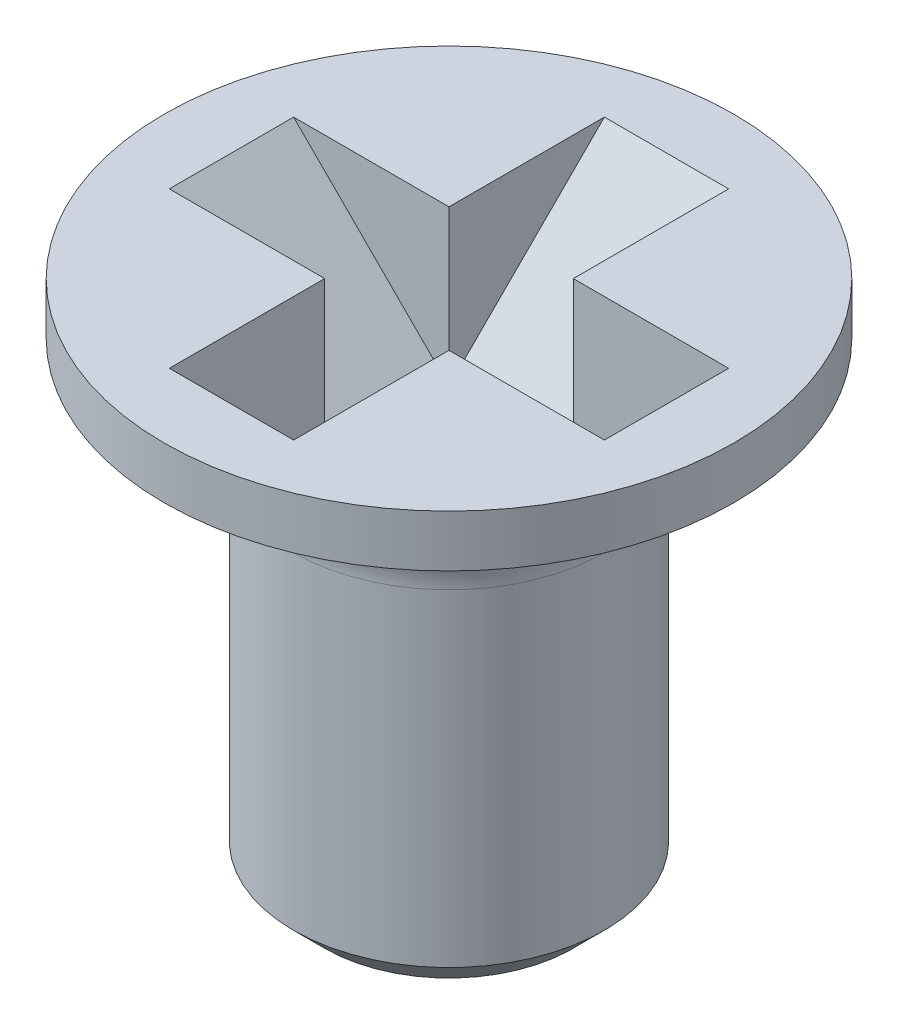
ISO-10303-21;
HEADER;
FILE_DESCRIPTION(('STEP AP214'),'2;1');
FILE_NAME('part.step','',(''),(''),'','','');
FILE_SCHEMA(('AUTOMOTIVE_DESIGN { 1 0 10303 214 1 1 1 1 }'));
ENDSEC;
DATA;
#1=APPLICATION_CONTEXT('core data for automotive mechanical design processes');
#2=APPLICATION_PROTOCOL_DEFINITION('international standard','automotive_design',2000,#1);
#3=PRODUCT_CONTEXT('',#1,'mechanical');
#4=PRODUCT('Part','Part','',(#3));
#5=PRODUCT_RELATED_PRODUCT_CATEGORY('part','',(#4));
#6=PRODUCT_DEFINITION_FORMATION('','',#4);
#7=PRODUCT_DEFINITION_CONTEXT('part definition',#1,'design');
#8=PRODUCT_DEFINITION('design','',#6,#7);
#9=PRODUCT_DEFINITION_SHAPE('','',#8);
#10=(LENGTH_UNIT() NAMED_UNIT(*) SI_UNIT(.MILLI.,.METRE.));
#11=(NAMED_UNIT(*) PLANE_ANGLE_UNIT() SI_UNIT($,.RADIAN.));
#12=(NAMED_UNIT(*) SI_UNIT($,.STERADIAN.) SOLID_ANGLE_UNIT());
#13=UNCERTAINTY_MEASURE_WITH_UNIT(LENGTH_MEASURE(1.E-05),#10,'distance_accuracy_value','');
#14=(GEOMETRIC_REPRESENTATION_CONTEXT(3) GLOBAL_UNCERTAINTY_ASSIGNED_CONTEXT((#13)) GLOBAL_UNIT_ASSIGNED_CONTEXT((#10,
#11,#12)) REPRESENTATION_CONTEXT('',''));
#15=CARTESIAN_POINT('',(0.,0.,0.));
#16=DIRECTION('',(0.,0.,1.));
#17=DIRECTION('',(1.,0.,0.));
#18=AXIS2_PLACEMENT_3D('',#15,#16,#17);
#19=CARTESIAN_POINT('',(0.,0.,0.6));
#20=DIRECTION('',(0.,0.,-1.));
#21=DIRECTION('',(-1.,0.,0.));
#22=AXIS2_PLACEMENT_3D('',#19,#20,#21);
#23=PLANE('',#22);
#24=DIRECTION('',(0.707106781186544,-0.707106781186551,0.));
#25=VECTOR('',#24,1.);
#26=CARTESIAN_POINT('',(-0.6,-1.5,0.6));
#27=LINE('',#26,#25);
#28=CARTESIAN_POINT('',(-0.599999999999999,-1.5,0.6));
#29=VERTEX_POINT('',#28);
#30=CARTESIAN_POINT('',(-2.09999999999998,0.,0.6));
#31=VERTEX_POINT('',#30);
#32=EDGE_CURVE('E96',#29,#31,#27,.F.);
#33=ORIENTED_EDGE('',*,*,#32,.T.);
#34=DIRECTION('',(-1.,0.,0.));
#35=VECTOR('',#34,1.);
#36=CARTESIAN_POINT('',(0.,0.,0.6));
#37=LINE('',#36,#35);
#38=CARTESIAN_POINT('',(-0.599999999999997,0.,0.6));
#39=VERTEX_POINT('',#38);
#40=EDGE_CURVE('E77',#31,#39,#37,.F.);
#41=ORIENTED_EDGE('',*,*,#40,.T.);
#42=DIRECTION('',(0.,1.,0.));
#43=VECTOR('',#42,1.);
#44=CARTESIAN_POINT('',(-0.599999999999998,0.,0.6));
#45=LINE('',#44,#43);
#46=EDGE_CURVE('E83',#39,#29,#45,.F.);
#47=ORIENTED_EDGE('',*,*,#46,.T.);
#48=EDGE_LOOP('',(#33,#41,#47));
#49=FACE_BOUND('',#48,.T.);
#50=ADVANCED_FACE('F16',(#49),#23,.T.);
#51=CARTESIAN_POINT('',(-0.6,-1.5,-0.6));
#52=DIRECTION('',(-0.707106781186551,-0.707106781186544,0.));
#53=DIRECTION('',(0.707106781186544,-0.707106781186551,0.));
#54=AXIS2_PLACEMENT_3D('',#51,#52,#53);
#55=PLANE('',#54);
#56=DIRECTION('',(0.,0.,1.));
#57=VECTOR('',#56,1.);
#58=CARTESIAN_POINT('',(-0.600000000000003,-1.5,-0.6));
#59=LINE('',#58,#57);
#60=CARTESIAN_POINT('',(-0.600000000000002,-1.5,-0.599999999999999));
#61=VERTEX_POINT('',#60);
#62=EDGE_CURVE('E100',#61,#29,#59,.T.);
#63=ORIENTED_EDGE('',*,*,#62,.F.);
#64=DIRECTION('',(-0.707106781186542,0.707106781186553,0.));
#65=VECTOR('',#64,1.);
#66=CARTESIAN_POINT('',(-0.600000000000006,-1.5,-0.6));
#67=LINE('',#66,#65);
#68=CARTESIAN_POINT('',(-2.09999999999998,0.,-0.6));
#69=VERTEX_POINT('',#68);
#70=EDGE_CURVE('E168',#61,#69,#67,.T.);
#71=ORIENTED_EDGE('',*,*,#70,.T.);
#72=DIRECTION('',(0.,0.,1.));
#73=VECTOR('',#72,1.);
#74=CARTESIAN_POINT('',(-2.09999999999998,0.,-0.6));
#75=LINE('',#74,#73);
#76=EDGE_CURVE('E98',#31,#69,#75,.F.);
#77=ORIENTED_EDGE('',*,*,#76,.F.);
#78=ORIENTED_EDGE('',*,*,#32,.F.);
#79=EDGE_LOOP('',(#63,#71,#77,#78));
#80=FACE_BOUND('',#79,.T.);
#81=ADVANCED_FACE('F210',(#80),#55,.F.);
#82=CARTESIAN_POINT('',(0.,0.,-0.6));
#83=DIRECTION('',(0.,0.,-1.));
#84=DIRECTION('',(-1.,0.,0.));
#85=AXIS2_PLACEMENT_3D('',#82,#83,#84);
#86=PLANE('',#85);
#87=DIRECTION('',(0.,1.,0.));
#88=VECTOR('',#87,1.);
#89=CARTESIAN_POINT('',(-0.600000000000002,0.,-0.599999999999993));
#90=LINE('',#89,#88);
#91=CARTESIAN_POINT('',(-0.600000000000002,0.,-0.599999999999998));
#92=VERTEX_POINT('',#91);
#93=EDGE_CURVE('E165',#61,#92,#90,.T.);
#94=ORIENTED_EDGE('',*,*,#93,.T.);
#95=DIRECTION('',(-1.,0.,0.));
#96=VECTOR('',#95,1.);
#97=CARTESIAN_POINT('',(0.,0.,-0.6));
#98=LINE('',#97,#96);
#99=EDGE_CURVE('E171',#69,#92,#98,.F.);
#100=ORIENTED_EDGE('',*,*,#99,.F.);
#101=ORIENTED_EDGE('',*,*,#70,.F.);
#102=EDGE_LOOP('',(#94,#100,#101));
#103=FACE_BOUND('',#102,.T.);
#104=ADVANCED_FACE('F209',(#103),#86,.F.);
#105=CARTESIAN_POINT('',(-0.6,0.,0.));
#106=DIRECTION('',(-1.,0.,0.));
#107=DIRECTION('',(0.,0.,1.));
#108=AXIS2_PLACEMENT_3D('',#105,#106,#107);
#109=PLANE('',#108);
#110=DIRECTION('',(0.,0.,1.));
#111=VECTOR('',#110,1.);
#112=CARTESIAN_POINT('',(-0.6,0.,0.));
#113=LINE('',#112,#111);
#114=CARTESIAN_POINT('',(-0.600000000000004,0.,-2.09999999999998));
#115=VERTEX_POINT('',#114);
#116=EDGE_CURVE('E163',#92,#115,#113,.F.);
#117=ORIENTED_EDGE('',*,*,#116,.F.);
#118=ORIENTED_EDGE('',*,*,#93,.F.);
#119=DIRECTION('',(0.,0.707106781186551,-0.707106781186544));
#120=VECTOR('',#119,1.);
#121=CARTESIAN_POINT('',(-0.600000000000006,-1.49999999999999,-0.6));
#122=LINE('',#121,#120);
#123=EDGE_CURVE('E155',#61,#115,#122,.T.);
#124=ORIENTED_EDGE('',*,*,#123,.T.);
#125=EDGE_LOOP('',(#117,#118,#124));
#126=FACE_BOUND('',#125,.T.);
#127=ADVANCED_FACE('F206',(#126),#109,.F.);
#128=CARTESIAN_POINT('',(0.599999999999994,-1.5,-0.600000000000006));
#129=DIRECTION('',(0.,-0.707106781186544,-0.707106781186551));
#130=DIRECTION('',(0.,0.707106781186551,-0.707106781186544));
#131=AXIS2_PLACEMENT_3D('',#128,#129,#130);
#132=PLANE('',#131);
#133=DIRECTION('',(1.,0.,0.));
#134=VECTOR('',#133,1.);
#135=CARTESIAN_POINT('',(0.599999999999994,-1.5,-0.600000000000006));
#136=LINE('',#135,#134);
#137=CARTESIAN_POINT('',(0.599999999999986,-1.5,-0.600000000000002));
#138=VERTEX_POINT('',#137);
#139=EDGE_CURVE('E158',#138,#61,#136,.F.);
#140=ORIENTED_EDGE('',*,*,#139,.F.);
#141=DIRECTION('',(0.,0.707106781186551,-0.707106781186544));
#142=VECTOR('',#141,1.);
#143=CARTESIAN_POINT('',(0.599999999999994,-1.5,-0.600000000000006));
#144=LINE('',#143,#142);
#145=CARTESIAN_POINT('',(0.599999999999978,0.,-2.09999999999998));
#146=VERTEX_POINT('',#145);
#147=EDGE_CURVE('E152',#138,#146,#144,.T.);
#148=ORIENTED_EDGE('',*,*,#147,.T.);
#149=DIRECTION('',(1.,0.,0.));
#150=VECTOR('',#149,1.);
#151=CARTESIAN_POINT('',(0.599999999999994,0.,-2.09999999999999));
#152=LINE('',#151,#150);
#153=EDGE_CURVE('E161',#115,#146,#152,.T.);
#154=ORIENTED_EDGE('',*,*,#153,.F.);
#155=ORIENTED_EDGE('',*,*,#123,.F.);
#156=EDGE_LOOP('',(#140,#148,#154,#155));
#157=FACE_BOUND('',#156,.T.);
#158=ADVANCED_FACE('F202',(#157),#132,.F.);
#159=CARTESIAN_POINT('',(0.6,0.,0.));
#160=DIRECTION('',(1.,0.,0.));
#161=DIRECTION('',(0.,0.,-1.));
#162=AXIS2_PLACEMENT_3D('',#159,#160,#161);
#163=PLANE('',#162);
#164=DIRECTION('',(0.,0.,-1.));
#165=VECTOR('',#164,1.);
#166=CARTESIAN_POINT('',(0.6,0.,0.));
#167=LINE('',#166,#165);
#168=CARTESIAN_POINT('',(0.599999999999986,0.,-0.6));
#169=VERTEX_POINT('',#168);
#170=EDGE_CURVE('E150',#146,#169,#167,.F.);
#171=ORIENTED_EDGE('',*,*,#170,.F.);
#172=ORIENTED_EDGE('',*,*,#147,.F.);
#173=DIRECTION('',(0.,1.,0.));
#174=VECTOR('',#173,1.);
#175=CARTESIAN_POINT('',(0.599999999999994,0.,-0.6));
#176=LINE('',#175,#174);
#177=EDGE_CURVE('E144',#169,#138,#176,.F.);
#178=ORIENTED_EDGE('',*,*,#177,.F.);
#179=EDGE_LOOP('',(#171,#172,#178));
#180=FACE_BOUND('',#179,.T.);
#181=ADVANCED_FACE('F199',(#180),#163,.F.);
#182=CARTESIAN_POINT('',(0.,0.,-0.6));
#183=DIRECTION('',(0.,0.,1.));
#184=DIRECTION('',(1.,0.,0.));
#185=AXIS2_PLACEMENT_3D('',#182,#183,#184);
#186=PLANE('',#185);
#187=DIRECTION('',(1.,0.,0.));
#188=VECTOR('',#187,1.);
#189=CARTESIAN_POINT('',(0.,0.,-0.6));
#190=LINE('',#189,#188);
#191=CARTESIAN_POINT('',(2.09999999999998,0.,-0.600000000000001));
#192=VERTEX_POINT('',#191);
#193=EDGE_CURVE('E147',#192,#169,#190,.F.);
#194=ORIENTED_EDGE('',*,*,#193,.T.);
#195=ORIENTED_EDGE('',*,*,#177,.T.);
#196=DIRECTION('',(0.707106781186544,0.707106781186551,0.));
#197=VECTOR('',#196,1.);
#198=CARTESIAN_POINT('',(0.6,-1.5,-0.600000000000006));
#199=LINE('',#198,#197);
#200=EDGE_CURVE('E136',#138,#192,#199,.T.);
#201=ORIENTED_EDGE('',*,*,#200,.T.);
#202=EDGE_LOOP('',(#194,#195,#201));
#203=FACE_BOUND('',#202,.T.);
#204=ADVANCED_FACE('F195',(#203),#186,.T.);
#205=CARTESIAN_POINT('',(0.6,-1.5,0.6));
#206=DIRECTION('',(0.707106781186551,-0.707106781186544,0.));
#207=DIRECTION('',(0.707106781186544,0.707106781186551,0.));
#208=AXIS2_PLACEMENT_3D('',#205,#206,#207);
#209=PLANE('',#208);
#210=DIRECTION('',(0.,0.,1.));
#211=VECTOR('',#210,1.);
#212=CARTESIAN_POINT('',(0.6,-1.5,0.6));
#213=LINE('',#212,#211);
#214=CARTESIAN_POINT('',(0.6,-1.5,0.6));
#215=VERTEX_POINT('',#214);
#216=EDGE_CURVE('E139',#215,#138,#213,.F.);
#217=ORIENTED_EDGE('',*,*,#216,.F.);
#218=DIRECTION('',(0.707106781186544,0.707106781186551,0.));
#219=VECTOR('',#218,1.);
#220=CARTESIAN_POINT('',(0.6,-1.5,0.6));
#221=LINE('',#220,#219);
#222=CARTESIAN_POINT('',(2.09999999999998,0.,0.6));
#223=VERTEX_POINT('',#222);
#224=EDGE_CURVE('E133',#215,#223,#221,.T.);
#225=ORIENTED_EDGE('',*,*,#224,.T.);
#226=DIRECTION('',(0.,0.,1.));
#227=VECTOR('',#226,1.);
#228=CARTESIAN_POINT('',(2.09999999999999,0.,0.6));
#229=LINE('',#228,#227);
#230=EDGE_CURVE('E142',#192,#223,#229,.T.);
#231=ORIENTED_EDGE('',*,*,#230,.F.);
#232=ORIENTED_EDGE('',*,*,#200,.F.);
#233=EDGE_LOOP('',(#217,#225,#231,#232));
#234=FACE_BOUND('',#233,.T.);
#235=ADVANCED_FACE('F191',(#234),#209,.F.);
#236=CARTESIAN_POINT('',(0.,0.,0.6));
#237=DIRECTION('',(0.,0.,1.));
#238=DIRECTION('',(1.,0.,0.));
#239=AXIS2_PLACEMENT_3D('',#236,#237,#238);
#240=PLANE('',#239);
#241=DIRECTION('',(1.,0.,0.));
#242=VECTOR('',#241,1.);
#243=CARTESIAN_POINT('',(0.,0.,0.6));
#244=LINE('',#243,#242);
#245=CARTESIAN_POINT('',(0.600000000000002,0.,0.6));
#246=VERTEX_POINT('',#245);
#247=EDGE_CURVE('E94',#223,#246,#244,.F.);
#248=ORIENTED_EDGE('',*,*,#247,.F.);
#249=ORIENTED_EDGE('',*,*,#224,.F.);
#250=DIRECTION('',(0.,1.,0.));
#251=VECTOR('',#250,1.);
#252=CARTESIAN_POINT('',(0.600000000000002,0.,0.6));
#253=LINE('',#252,#251);
#254=EDGE_CURVE('E128',#246,#215,#253,.F.);
#255=ORIENTED_EDGE('',*,*,#254,.F.);
#256=EDGE_LOOP('',(#248,#249,#255));
#257=FACE_BOUND('',#256,.T.);
#258=ADVANCED_FACE('F188',(#257),#240,.F.);
#259=CARTESIAN_POINT('',(-0.6,0.,0.));
#260=DIRECTION('',(-1.,0.,0.));
#261=DIRECTION('',(0.,0.,1.));
#262=AXIS2_PLACEMENT_3D('',#259,#260,#261);
#263=PLANE('',#262);
#264=DIRECTION('',(0.,0.,1.));
#265=VECTOR('',#264,1.);
#266=CARTESIAN_POINT('',(-0.6,0.,0.));
#267=LINE('',#266,#265);
#268=CARTESIAN_POINT('',(-0.599999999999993,0.,2.09999999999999));
#269=VERTEX_POINT('',#268);
#270=EDGE_CURVE('E85',#269,#39,#267,.F.);
#271=ORIENTED_EDGE('',*,*,#270,.F.);
#272=DIRECTION('',(0.,-0.707106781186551,-0.707106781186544));
#273=VECTOR('',#272,1.);
#274=CARTESIAN_POINT('',(-0.599999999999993,-1.5,0.600000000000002));
#275=LINE('',#274,#273);
#276=EDGE_CURVE('E87',#269,#29,#275,.T.);
#277=ORIENTED_EDGE('',*,*,#276,.T.);
#278=ORIENTED_EDGE('',*,*,#46,.F.);
#279=EDGE_LOOP('',(#271,#277,#278));
#280=FACE_BOUND('',#279,.T.);
#281=ADVANCED_FACE('F84',(#280),#263,.F.);
#282=CARTESIAN_POINT('',(-0.6,-1.5,-0.6));
#283=DIRECTION('',(0.,-1.,0.));
#284=DIRECTION('',(0.,0.,-1.));
#285=AXIS2_PLACEMENT_3D('',#282,#283,#284);
#286=PLANE('',#285);
#287=ORIENTED_EDGE('',*,*,#216,.T.);
#288=ORIENTED_EDGE('',*,*,#139,.T.);
#289=ORIENTED_EDGE('',*,*,#62,.T.);
#290=DIRECTION('',(1.,0.,0.));
#291=VECTOR('',#290,1.);
#292=CARTESIAN_POINT('',(-0.599999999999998,-1.5,0.600000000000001));
#293=LINE('',#292,#291);
#294=EDGE_CURVE('E124',#29,#215,#293,.T.);
#295=ORIENTED_EDGE('',*,*,#294,.T.);
#296=EDGE_LOOP('',(#287,#288,#289,#295));
#297=FACE_BOUND('',#296,.T.);
#298=ADVANCED_FACE('F175',(#297),#286,.F.);
#299=CARTESIAN_POINT('',(0.6,0.,0.));
#300=DIRECTION('',(-1.,0.,0.));
#301=DIRECTION('',(0.,0.,1.));
#302=AXIS2_PLACEMENT_3D('',#299,#300,#301);
#303=PLANE('',#302);
#304=DIRECTION('',(0.,0.,1.));
#305=VECTOR('',#304,1.);
#306=CARTESIAN_POINT('',(0.6,0.,0.));
#307=LINE('',#306,#305);
#308=CARTESIAN_POINT('',(0.600000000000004,0.,2.09999999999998));
#309=VERTEX_POINT('',#308);
#310=EDGE_CURVE('E34',#309,#246,#307,.F.);
#311=ORIENTED_EDGE('',*,*,#310,.T.);
#312=ORIENTED_EDGE('',*,*,#254,.T.);
#313=DIRECTION('',(0.,-0.707106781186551,-0.707106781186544));
#314=VECTOR('',#313,1.);
#315=CARTESIAN_POINT('',(0.6,-1.5,0.6));
#316=LINE('',#315,#314);
#317=EDGE_CURVE('E122',#215,#309,#316,.F.);
#318=ORIENTED_EDGE('',*,*,#317,.T.);
#319=EDGE_LOOP('',(#311,#312,#318));
#320=FACE_BOUND('',#319,.T.);
#321=ADVANCED_FACE('F183',(#320),#303,.T.);
#322=CARTESIAN_POINT('',(-0.599999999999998,-1.5,0.600000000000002));
#323=DIRECTION('',(0.,-0.707106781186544,0.707106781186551));
#324=DIRECTION('',(0.,-0.707106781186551,-0.707106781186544));
#325=AXIS2_PLACEMENT_3D('',#322,#323,#324);
#326=PLANE('',#325);
#327=ORIENTED_EDGE('',*,*,#294,.F.);
#328=ORIENTED_EDGE('',*,*,#276,.F.);
#329=DIRECTION('',(1.,0.,0.));
#330=VECTOR('',#329,1.);
#331=CARTESIAN_POINT('',(0.,0.,2.09999999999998));
#332=LINE('',#331,#330);
#333=EDGE_CURVE('E93',#309,#269,#332,.F.);
#334=ORIENTED_EDGE('',*,*,#333,.F.);
#335=ORIENTED_EDGE('',*,*,#317,.F.);
#336=EDGE_LOOP('',(#327,#328,#334,#335));
#337=FACE_BOUND('',#336,.T.);
#338=ADVANCED_FACE('F181',(#337),#326,.F.);
#339=CARTESIAN_POINT('',(0.,0.,0.));
#340=DIRECTION('',(0.,1.,0.));
#341=DIRECTION('',(0.,0.,1.));
#342=AXIS2_PLACEMENT_3D('',#339,#340,#341);
#343=PLANE('',#342);
#344=CARTESIAN_POINT('',(0.,0.,0.));
#345=DIRECTION('',(0.,1.,0.));
#346=DIRECTION('',(0.,0.,1.));
#347=AXIS2_PLACEMENT_3D('',#344,#345,#346);
#348=CIRCLE('',#347,2.75);
#349=CARTESIAN_POINT('',(0.,0.,2.75));
#350=VERTEX_POINT('',#349);
#351=EDGE_CURVE('E19',#350,#350,#348,.F.);
#352=ORIENTED_EDGE('',*,*,#351,.F.);
#353=EDGE_LOOP('',(#352));
#354=FACE_BOUND('',#353,.T.);
#355=ORIENTED_EDGE('',*,*,#310,.F.);
#356=ORIENTED_EDGE('',*,*,#333,.T.);
#357=ORIENTED_EDGE('',*,*,#270,.T.);
#358=ORIENTED_EDGE('',*,*,#40,.F.);
#359=ORIENTED_EDGE('',*,*,#76,.T.);
#360=ORIENTED_EDGE('',*,*,#99,.T.);
#361=ORIENTED_EDGE('',*,*,#116,.T.);
#362=ORIENTED_EDGE('',*,*,#153,.T.);
#363=ORIENTED_EDGE('',*,*,#170,.T.);
#364=ORIENTED_EDGE('',*,*,#193,.F.);
#365=ORIENTED_EDGE('',*,*,#230,.T.);
#366=ORIENTED_EDGE('',*,*,#247,.T.);
#367=EDGE_LOOP('',(#355,#356,#357,#358,#359,#360,#361,#362,#363,#364,#365,#366));
#368=FACE_BOUND('',#367,.T.);
#369=ADVANCED_FACE('F91',(#354,#368),#343,.T.);
#370=CARTESIAN_POINT('',(0.,8.01052109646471,0.));
#371=DIRECTION('',(0.,1.,0.));
#372=DIRECTION('',(0.,0.,1.));
#373=AXIS2_PLACEMENT_3D('',#370,#371,#372);
#374=CYLINDRICAL_SURFACE('',#373,2.75);
#375=ORIENTED_EDGE('',*,*,#351,.T.);
#376=EDGE_LOOP('',(#375));
#377=FACE_BOUND('',#376,.T.);
#378=CARTESIAN_POINT('',(0.,-0.499999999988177,0.));
#379=DIRECTION('',(0.,1.,0.));
#380=DIRECTION('',(0.,0.,1.));
#381=AXIS2_PLACEMENT_3D('',#378,#379,#380);
#382=CIRCLE('',#381,2.75000000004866);
#383=CARTESIAN_POINT('',(0.,-0.499999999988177,2.75000000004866));
#384=VERTEX_POINT('',#383);
#385=EDGE_CURVE('E106',#384,#384,#382,.F.);
#386=ORIENTED_EDGE('',*,*,#385,.F.);
#387=EDGE_LOOP('',(#386));
#388=FACE_BOUND('',#387,.T.);
#389=ADVANCED_FACE('F251',(#377,#388),#374,.T.);
#390=CARTESIAN_POINT('',(-1.5,-5.,0.));
#391=DIRECTION('',(0.,-1.,0.));
#392=DIRECTION('',(0.,0.,-1.));
#393=AXIS2_PLACEMENT_3D('',#390,#391,#392);
#394=PLANE('',#393);
#395=CARTESIAN_POINT('',(0.,-4.99999999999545,0.));
#396=DIRECTION('',(0.,1.,0.));
#397=DIRECTION('',(0.,0.,1.));
#398=AXIS2_PLACEMENT_3D('',#395,#396,#397);
#399=CIRCLE('',#398,1.20000000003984);
#400=CARTESIAN_POINT('',(0.,-4.99999999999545,1.20000000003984));
#401=VERTEX_POINT('',#400);
#402=EDGE_CURVE('E103',#401,#401,#399,.T.);
#403=ORIENTED_EDGE('',*,*,#402,.F.);
#404=EDGE_LOOP('',(#403));
#405=FACE_BOUND('',#404,.T.);
#406=ADVANCED_FACE('F247',(#405),#394,.T.);
#407=CARTESIAN_POINT('',(0.,-0.500000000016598,0.));
#408=DIRECTION('',(0.,1.,0.));
#409=DIRECTION('',(0.,0.,1.));
#410=AXIS2_PLACEMENT_3D('',#407,#408,#409);
#411=CONICAL_SURFACE('',#410,2.74999999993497,1.19028994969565);
#412=ORIENTED_EDGE('',*,*,#385,.T.);
#413=EDGE_LOOP('',(#412));
#414=FACE_BOUND('',#413,.T.);
#415=CARTESIAN_POINT('',(0.,-0.798845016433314,0.));
#416=DIRECTION('',(0.,1.,0.));
#417=DIRECTION('',(0.,0.,1.));
#418=AXIS2_PLACEMENT_3D('',#415,#416,#417);
#419=CIRCLE('',#418,2.00288745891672);
#420=CARTESIAN_POINT('',(0.,-0.798845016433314,2.00288745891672));
#421=VERTEX_POINT('',#420);
#422=EDGE_CURVE('E105',#421,#421,#419,.T.);
#423=ORIENTED_EDGE('',*,*,#422,.T.);
#424=EDGE_LOOP('',(#423));
#425=FACE_BOUND('',#424,.T.);
#426=ADVANCED_FACE('F243',(#414,#425),#411,.T.);
#427=CARTESIAN_POINT('',(0.,-4.70000000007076,0.));
#428=DIRECTION('',(0.,1.,0.));
#429=DIRECTION('',(0.,0.,1.));
#430=AXIS2_PLACEMENT_3D('',#427,#428,#429);
#431=CONICAL_SURFACE('',#430,1.50000000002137,0.785398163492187);
#432=CARTESIAN_POINT('',(0.,-4.7,0.));
#433=DIRECTION('',(0.,1.,0.));
#434=DIRECTION('',(0.,0.,1.));
#435=AXIS2_PLACEMENT_3D('',#432,#433,#434);
#436=CIRCLE('',#435,1.5);
#437=CARTESIAN_POINT('',(0.,-4.7,1.5));
#438=VERTEX_POINT('',#437);
#439=EDGE_CURVE('E25',#438,#438,#436,.T.);
#440=ORIENTED_EDGE('',*,*,#439,.F.);
#441=EDGE_LOOP('',(#440));
#442=FACE_BOUND('',#441,.T.);
#443=ORIENTED_EDGE('',*,*,#402,.T.);
#444=EDGE_LOOP('',(#443));
#445=FACE_BOUND('',#444,.T.);
#446=ADVANCED_FACE('F226',(#442,#445),#431,.T.);
#447=CARTESIAN_POINT('',(0.,-1.54162636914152,0.));
#448=DIRECTION('',(0.,1.,0.));
#449=DIRECTION('',(0.,0.,1.));
#450=AXIS2_PLACEMENT_3D('',#447,#448,#449);
#451=TOROIDAL_SURFACE('',#450,2.3,0.8);
#452=ORIENTED_EDGE('',*,*,#422,.F.);
#453=EDGE_LOOP('',(#452));
#454=FACE_BOUND('',#453,.T.);
#455=CARTESIAN_POINT('',(0.,-1.54162636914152,0.));
#456=DIRECTION('',(0.,1.,0.));
#457=DIRECTION('',(0.,0.,1.));
#458=AXIS2_PLACEMENT_3D('',#455,#456,#457);
#459=CIRCLE('',#458,1.5);
#460=CARTESIAN_POINT('',(0.,-1.54162636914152,1.5));
#461=VERTEX_POINT('',#460);
#462=EDGE_CURVE('E11',#461,#461,#459,.F.);
#463=ORIENTED_EDGE('',*,*,#462,.F.);
#464=EDGE_LOOP('',(#463));
#465=FACE_BOUND('',#464,.T.);
#466=ADVANCED_FACE('F220',(#454,#465),#451,.F.);
#467=CARTESIAN_POINT('',(0.,8.01052109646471,0.));
#468=DIRECTION('',(0.,1.,0.));
#469=DIRECTION('',(0.,0.,1.));
#470=AXIS2_PLACEMENT_3D('',#467,#468,#469);
#471=CYLINDRICAL_SURFACE('',#470,1.5);
#472=ORIENTED_EDGE('',*,*,#462,.T.);
#473=EDGE_LOOP('',(#472));
#474=FACE_BOUND('',#473,.T.);
#475=ORIENTED_EDGE('',*,*,#439,.T.);
#476=EDGE_LOOP('',(#475));
#477=FACE_BOUND('',#476,.T.);
#478=ADVANCED_FACE('F218',(#474,#477),#471,.T.);
#479=CLOSED_SHELL('',(#50,#81,#104,#127,#158,#181,#204,#235,#258,#281,#298,#321,#338,#369,#389,
#406,#426,#446,#466,#478));
#480=MANIFOLD_SOLID_BREP('B1',#479);
#481=ADVANCED_BREP_SHAPE_REPRESENTATION('',(#18,#480),#14);
#482=SHAPE_DEFINITION_REPRESENTATION(#9,#481);
ENDSEC;
END-ISO-10303-21;
